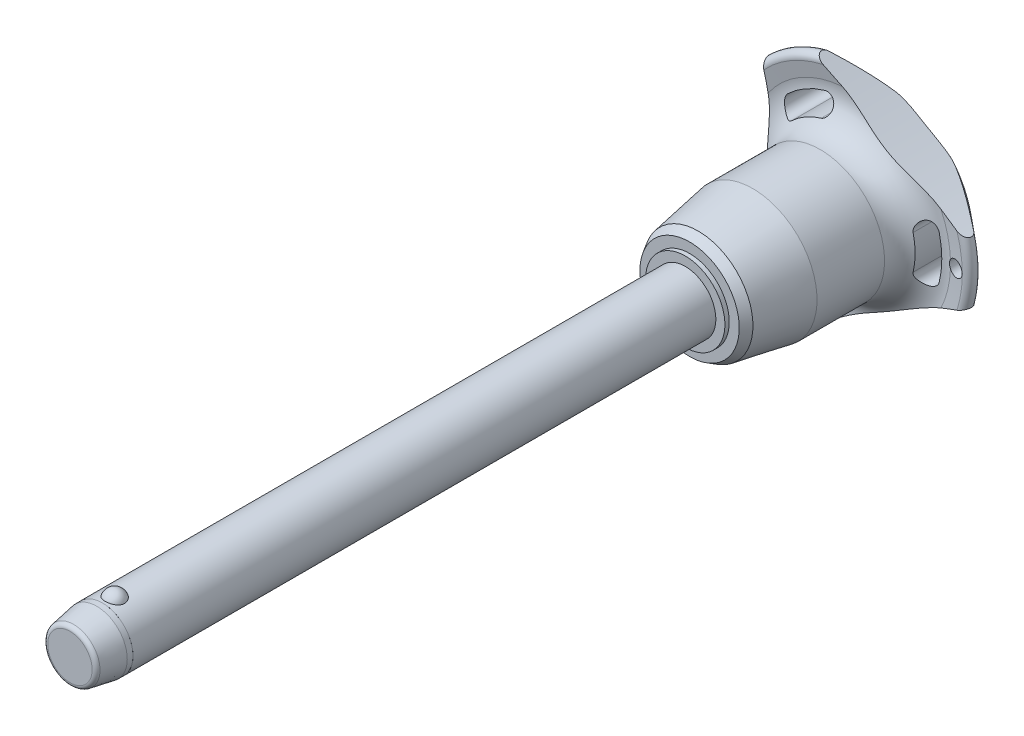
from build123d import *

# Parameters (mm, degrees)
SKETCH1_R           = 6
BOSS_EXTRUDE1_DEPTH = 110
SKETCH2_R           = 5.15
BOSS_EXTRUDE2_DEPTH = 39.7
BOSS_EXTRUDE3_START = 10.6
SKETCH1_2_R         = 6
BOSS_EXTRUDE3_DEPTH = 10.6
CHAMFER1_SIZE       = 5.3
CHAMFER1_SIZE2      = 0.934532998
FILLET1_R           = 0.85
SKETCH6_R           = 144.275
CUT_EXTRUDE1_DEPTH  = 154.440094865
CIRPATTERN1_COUNT   = 3
SKETCH7_R           = 1.5
CUT_EXTRUDE2_DEPTH  = 154.309245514
SKETCH8_R           = 6
SKETCH8_R_2         = 5.99
CUT_EXTRUDE3_DEPTH  = 6.36


with BuildPart() as part:
    # Sketch1 → Boss-Extrude1 (new body)
    with BuildSketch(Plane.XY):
        Circle(SKETCH1_R)
    extrude(amount=-BOSS_EXTRUDE1_DEPTH)

    # Sketch2 → Boss-Extrude2 (add)
    with BuildSketch(Plane(origin=(0, 0, -110), x_dir=(-1, 0, 0), z_dir=(0, 0, -1))):
        Circle(SKETCH2_R)
    extrude(amount=BOSS_EXTRUDE2_DEPTH)

    # Sketch3 → Revolve1 (revolve)
    with BuildSketch(Plane(origin=(0, 0, 0), x_dir=(0, 0, -1), z_dir=(1, 0, 0))):
        with BuildLine():
            Line((-1.854049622, 7.25), (-1.854049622, 3.25))
            ThreePointArc((-1.854049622, 3.25), (0.145950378, 5.25), (-1.854049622, 7.25))
        make_face()
        with BuildLine():
            Line((-1.854049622, -3.25), (-1.854049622, -7.25))
            ThreePointArc((-1.854049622, -7.25), (0.145950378, -5.25), (-1.854049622, -3.25))
        make_face()
    revolve(axis=Axis((0, -3.25, 1.854049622), (0, 1, 0)))

    # Sketch1_2 → Boss-Extrude3 (add)
    with BuildSketch(Plane.XY.offset(BOSS_EXTRUDE3_START)):
        Circle(SKETCH1_2_R)
    extrude(amount=-BOSS_EXTRUDE3_DEPTH)

    # Chamfer1
    chamfer1_edges = [part.edges().sort_by_distance(p)[0] for p in [
        (-6, 0, 10.6),
    ]]
    chamfer1_side = [part.faces().sort_by_distance(p)[0] for p in [
        (-6, 0, -49.7),
    ]]
    chamfer(chamfer1_edges, length=CHAMFER1_SIZE, length2=CHAMFER1_SIZE2, reference=chamfer1_side[0])

    # Fillet1
    fillet1_edges = [part.edges().sort_by_distance(p)[0] for p in [
        (-5.065467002, 0, 10.6),
        (5.15, 0, -149.7),
    ]]
    fillet(fillet1_edges, radius=FILLET1_R)

    # Sketch4 → Revolve2 (revolve)
    with BuildSketch(Plane(origin=(0, 0, 0), x_dir=(0, 0, -1), z_dir=(1, 0, 0)), mode=Mode.PRIVATE) as revolve2_sk:
        Polygon((110, 0), (110, 7.770471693), (110.85, 7.770471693), (110.85, 9.734414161), (112.550824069, 10.716385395), (123.233333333, 12.6), (136.466666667, 12.6), (136.466666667, 0), align=None)
    revolve(revolve2_sk.sketch.rotate(Axis((0, 0, -136.466666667), (0, 0, 1)), 90), axis=Axis((0, 0, -136.466666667), (0, 0, 1)))

    # Sketch5 → Revolve3 (revolve)
    with BuildSketch(Plane(origin=(0, 0, 0), x_dir=(0, 0, -1), z_dir=(1, 0, 0)), mode=Mode.PRIVATE) as revolve3_sk:
        with BuildLine():
            Line((142.379459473, 19.619255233), (141.900774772, 22.396148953))
            ThreePointArc((141.900774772, 22.396148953), (142.578274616, 23.688538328), (144.002586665, 23.371345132))
            Line((144.002586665, 23.371345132), (149.141488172, 17.247040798))
            ThreePointArc((149.141488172, 17.247040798), (149.7, 15.584758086), (148.978803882, 13.986322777))
            ThreePointArc((148.978803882, 13.986322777), (144.617427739, 7.589034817), (143.083333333, 0))
            Line((143.083333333, 0), (136.466666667, 0))
            Line((136.466666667, 0), (136.466666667, 12.6))
            ThreePointArc((136.466666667, 12.6), (141.055540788, 14.734481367), (142.379459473, 19.619255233))
        make_face()
    revolve(revolve3_sk.sketch.rotate(Axis((0, 0, -143.083333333), (0, 0, 1)), 90), axis=Axis((0, 0, -143.083333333), (0, 0, 1)))

    # Sketch6 → Cut-Extrude1 (cut, through all)
    with BuildSketch(Plane.XY):
        with Locations((-159.975, 0)):
            Circle(SKETCH6_R)
        with BuildLine():
            ThreePointArc((17.365443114, -4.192809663), (17.864441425, 0), (17.365443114, 4.192809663))
            ThreePointArc((17.365443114, 4.192809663), (15.247788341, 5.486749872), (13.953848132, 3.369095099))
            ThreePointArc((13.953848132, 3.369095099), (14.354813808, 0), (13.953848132, -3.369095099))
            ThreePointArc((13.953848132, -3.369095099), (15.247788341, -5.486749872), (17.365443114, -4.192809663))
        make_face()
    cut_extrude1 = extrude(amount=-CUT_EXTRUDE1_DEPTH, mode=Mode.SUBTRACT)

    # CirPattern1: Cut-Extrude1 ×3 about axis
    cirpattern1_axis = Axis((0, 0, 0), (0, 0, 1))
    for i in range(1, CIRPATTERN1_COUNT):
        add(cut_extrude1.rotate(cirpattern1_axis, i * 360 / CIRPATTERN1_COUNT), mode=Mode.SUBTRACT)

    # Sketch7 → Cut-Extrude2 (cut, through all)
    with BuildSketch(Plane.XY):
        with Locations(Location((20.864441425, 0, 0), (0, 0, 221.008319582))):
            Circle(SKETCH7_R)
    extrude(amount=-CUT_EXTRUDE2_DEPTH, mode=Mode.SUBTRACT)

    # Sketch8 → Cut-Extrude3 (cut)
    with BuildSketch(Plane.XY.offset(10.6)):
        Circle(SKETCH8_R)
        Circle(SKETCH8_R_2, mode=Mode.SUBTRACT)
    extrude(amount=-CUT_EXTRUDE3_DEPTH, mode=Mode.SUBTRACT)


solid = part.part
